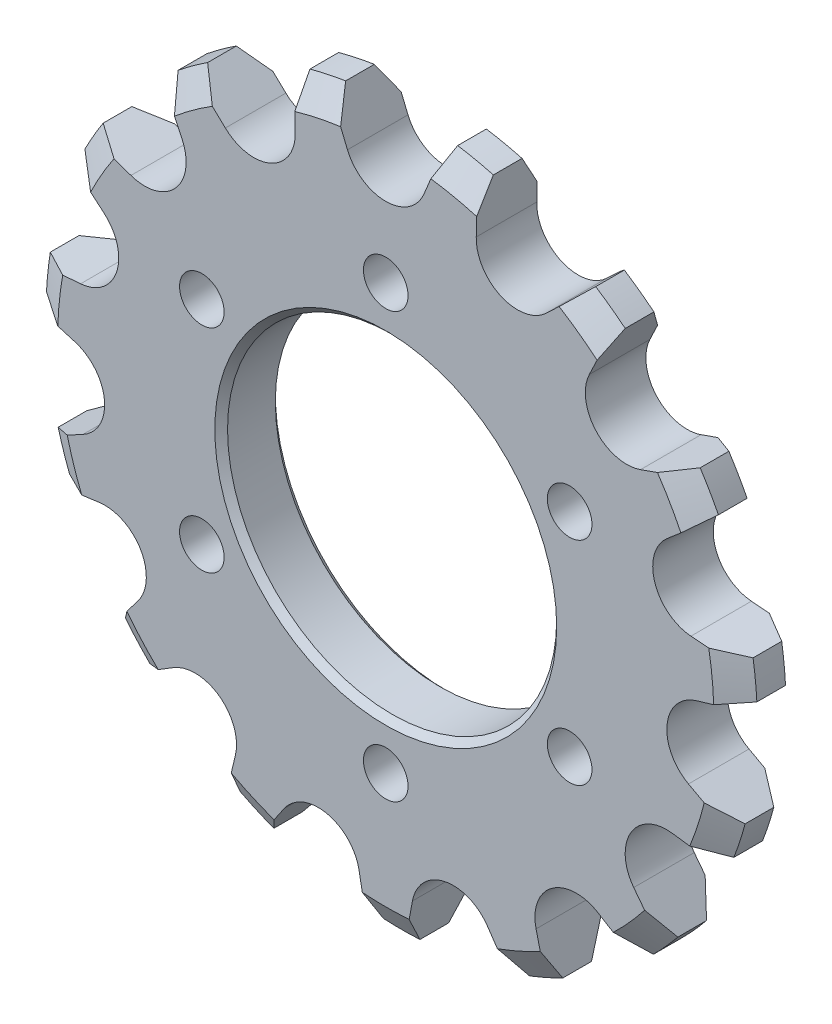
from build123d import *

# Parameters (mm, degrees)
SKETCH_1_R               = 33.5
EXTRUDE_1_DEPTH          = 5.7
CHAMFER_1_SIZE           = 1.5
CHAMFER_1_SIZE2          = 2.598076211
CUT_EXTRUDE_1_DEPTH      = 48.717816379
PATTERN_CIRCULAR_1_COUNT = 15
SKETCH_3_R               = 15.5
CUT_EXTRUDE_2_DEPTH      = 48.684328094
M5X0_8_1_D               = 4.2
PATTERN_CIRCULAR_2_COUNT = 6
CHAMFER_2_SIZE           = 0.6


with BuildPart() as part:
    # Sketch 1 → Extrude 1 (new body)
    with BuildSketch(Plane.XY):
        Circle(SKETCH_1_R)
    extrude(amount=EXTRUDE_1_DEPTH)

    # Chamfer 1
    chamfer_1_edges = [part.edges().sort_by_distance(p)[0] for p in [
        (-33.5, 0, 0),
        (-33.5, 0, 5.7),
    ]]
    chamfer_1_side = [part.faces().sort_by_distance(p)[0] for p in [
        (-33.5, 0, 2.85),
    ]]
    chamfer(chamfer_1_edges, length=CHAMFER_1_SIZE, length2=CHAMFER_1_SIZE2, reference=chamfer_1_side[0])

    # Sketch 2 → Cut-Extrude 1 (cut, through all)
    with BuildSketch(Plane.XY.offset(5.7)):
        with BuildLine():
            Line((-3.603130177, 29.047534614), (-5.274339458, 33.082190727))
            ThreePointArc((-5.274339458, 33.082190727), (0, 33.5), (5.274339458, 33.082190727))
            Line((5.274339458, 33.082190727), (3.603130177, 29.047534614))
            ThreePointArc((3.603130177, 29.047534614), (0, 26.64), (-3.603130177, 29.047534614))
        make_face()
    cut_extrude_1 = extrude(amount=-CUT_EXTRUDE_1_DEPTH, mode=Mode.SUBTRACT)

    # Pattern Circular 1: Cut-Extrude 1 ×15 about axis
    pattern_circular_1_axis = Axis((0, 0, 0), (0, 0, 1))
    for i in range(1, PATTERN_CIRCULAR_1_COUNT):
        add(cut_extrude_1.rotate(pattern_circular_1_axis, i * 360 / PATTERN_CIRCULAR_1_COUNT), mode=Mode.SUBTRACT)

    # Sketch 3 → Cut-Extrude 2 (cut, through all)
    with BuildSketch(Plane.XY.offset(5.7)):
        Circle(SKETCH_3_R)
    extrude(amount=-CUT_EXTRUDE_2_DEPTH, mode=Mode.SUBTRACT)

    # M5x0.8 _1 (through all)
    with Locations(Plane.XY.offset(5.7)):
        with Locations((0, 20)):
            m5x0_8_1 = Hole(M5X0_8_1_D / 2)

    # Pattern Circular 2: M5x0.8 _1 ×6 about axis
    pattern_circular_2_axis = Axis((0, 0, 0), (0, 0, 1))
    for i in range(1, PATTERN_CIRCULAR_2_COUNT):
        add(m5x0_8_1.rotate(pattern_circular_2_axis, i * 360 / PATTERN_CIRCULAR_2_COUNT), mode=Mode.SUBTRACT)

    # Chamfer 2
    chamfer_2_edges = [part.edges().sort_by_distance(p)[0] for p in [
        (-15.5, 0, 0),
        (-15.5, 0, 5.7),
    ]]
    chamfer(chamfer_2_edges, length=CHAMFER_2_SIZE)


solid = part.part
